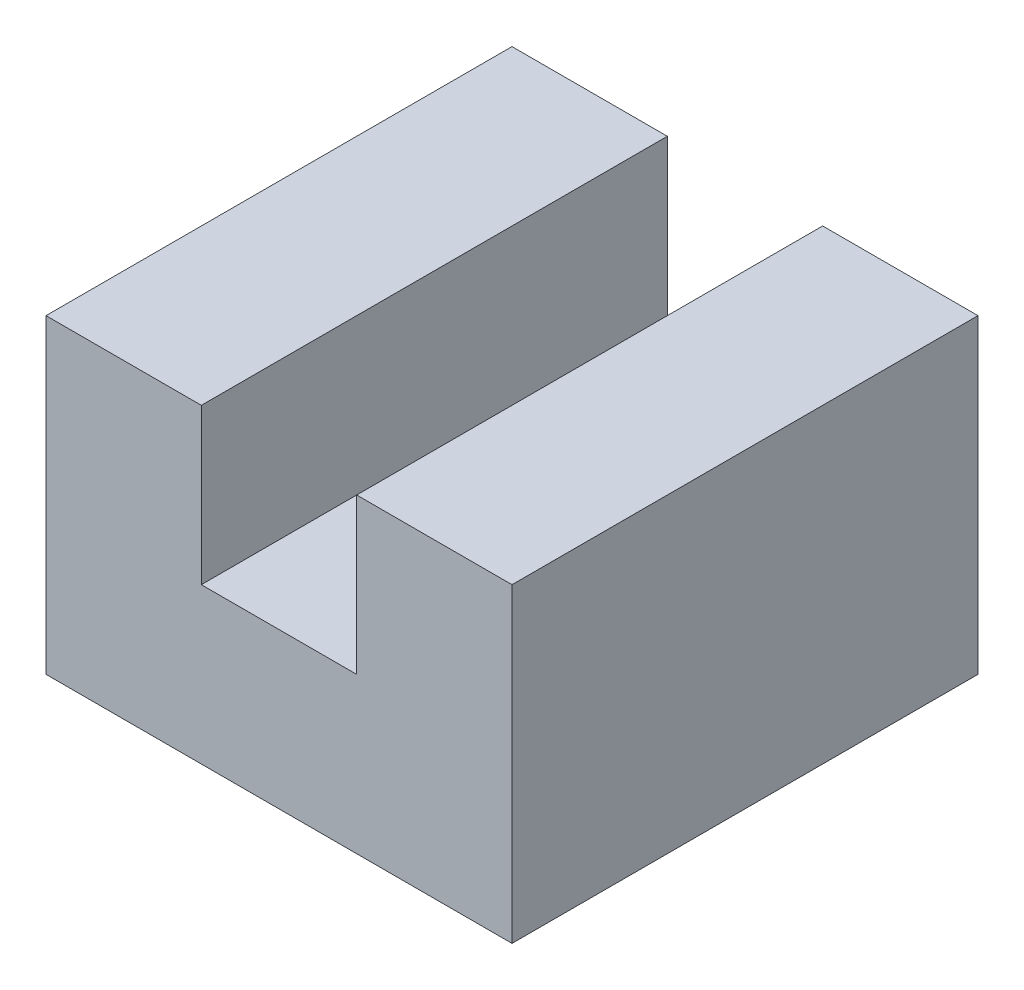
from build123d import *

# Parameters (mm, degrees)
EXTRUDE_1_DEPTH     = 60
SKETCH_2_R          = 10
CUT_EXTRUDE_2_DEPTH = 15


with BuildPart() as part:
    # Sketch 1 → Extrude 1 (new body)
    with BuildSketch(Plane.XY):
        Polygon((0, 0), (0, 40), (20, 40), (20, 20), (40, 20), (40, 40), (60, 40), (60, 0), align=None)
    extrude(amount=EXTRUDE_1_DEPTH)

    # Sketch 2 → Cut-Extrude 2 (cut)
    with BuildSketch(Plane.XZ):
        with Locations((30, 30)):
            Circle(SKETCH_2_R)
    extrude(amount=-CUT_EXTRUDE_2_DEPTH, mode=Mode.SUBTRACT)


solid = part.part
